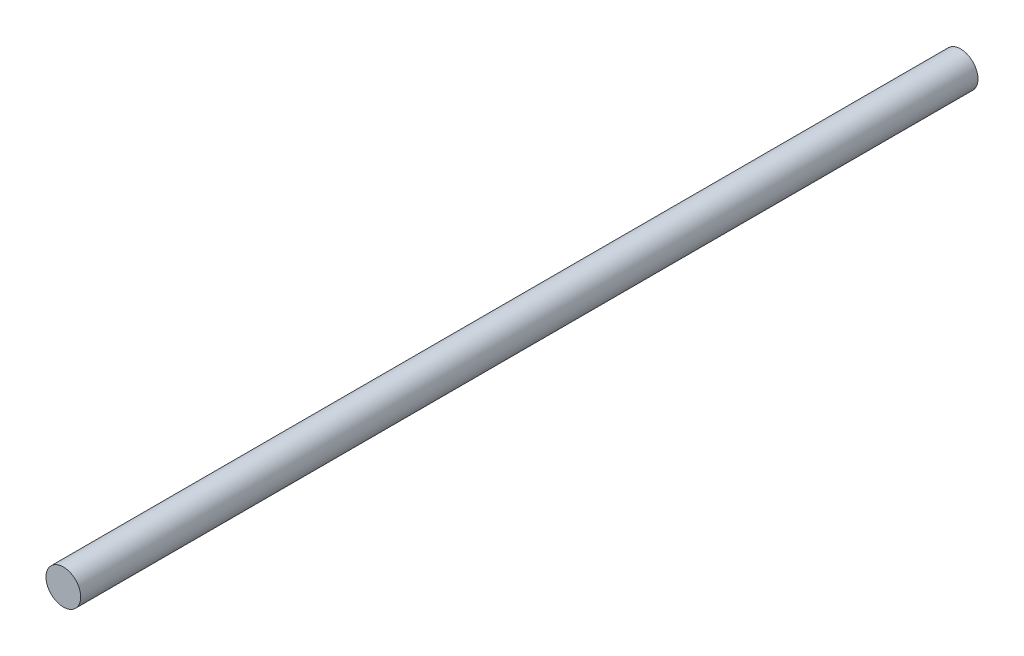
from build123d import *

# Parameters (mm, degrees)
SKETCH1_R           = 30
BOSS_EXTRUDE1_DEPTH = 1550


with BuildPart() as part:
    # Sketch1 → Boss-Extrude1 (new body)
    with BuildSketch(Plane.XY):
        Circle(SKETCH1_R)
    extrude(amount=-BOSS_EXTRUDE1_DEPTH)


solid = part.part
